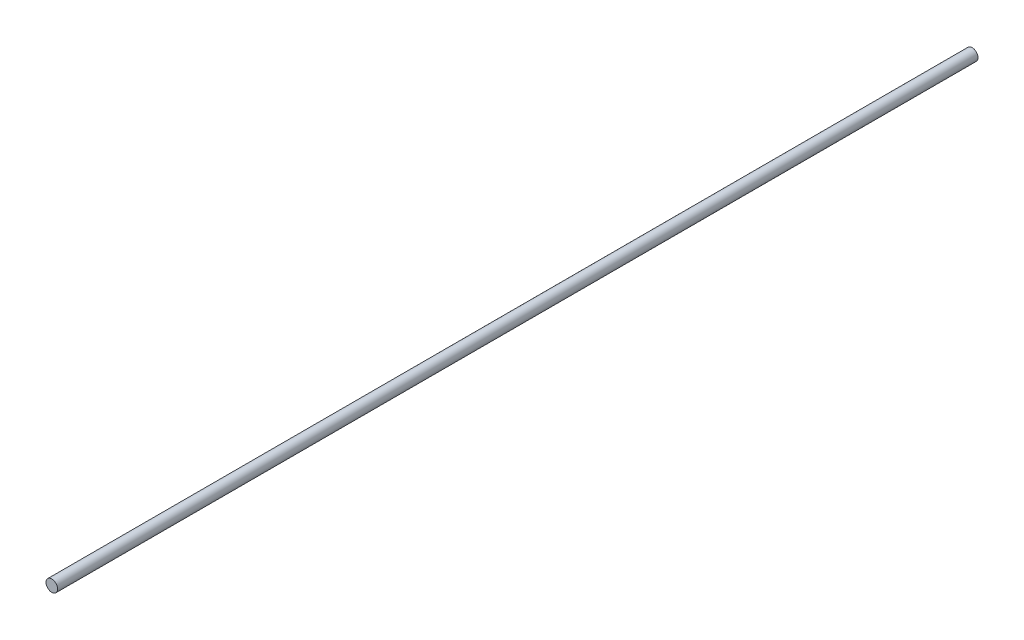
ISO-10303-21;
HEADER;
FILE_DESCRIPTION(('STEP AP214'),'2;1');
FILE_NAME('part.step','',(''),(''),'','','');
FILE_SCHEMA(('AUTOMOTIVE_DESIGN { 1 0 10303 214 1 1 1 1 }'));
ENDSEC;
DATA;
#1=APPLICATION_CONTEXT('core data for automotive mechanical design processes');
#2=APPLICATION_PROTOCOL_DEFINITION('international standard','automotive_design',2000,#1);
#3=PRODUCT_CONTEXT('',#1,'mechanical');
#4=PRODUCT('Part','Part','',(#3));
#5=PRODUCT_RELATED_PRODUCT_CATEGORY('part','',(#4));
#6=PRODUCT_DEFINITION_FORMATION('','',#4);
#7=PRODUCT_DEFINITION_CONTEXT('part definition',#1,'design');
#8=PRODUCT_DEFINITION('design','',#6,#7);
#9=PRODUCT_DEFINITION_SHAPE('','',#8);
#10=(LENGTH_UNIT() NAMED_UNIT(*) SI_UNIT(.MILLI.,.METRE.));
#11=(NAMED_UNIT(*) PLANE_ANGLE_UNIT() SI_UNIT($,.RADIAN.));
#12=(NAMED_UNIT(*) SI_UNIT($,.STERADIAN.) SOLID_ANGLE_UNIT());
#13=UNCERTAINTY_MEASURE_WITH_UNIT(LENGTH_MEASURE(1.E-05),#10,'distance_accuracy_value','');
#14=(GEOMETRIC_REPRESENTATION_CONTEXT(3) GLOBAL_UNCERTAINTY_ASSIGNED_CONTEXT((#13)) GLOBAL_UNIT_ASSIGNED_CONTEXT((#10,
#11,#12)) REPRESENTATION_CONTEXT('',''));
#15=CARTESIAN_POINT('',(0.,0.,0.));
#16=DIRECTION('',(0.,0.,1.));
#17=DIRECTION('',(1.,0.,0.));
#18=AXIS2_PLACEMENT_3D('',#15,#16,#17);
#19=CARTESIAN_POINT('',(0.,0.,-4750.));
#20=DIRECTION('',(0.,0.,1.));
#21=DIRECTION('',(1.,0.,0.));
#22=AXIS2_PLACEMENT_3D('',#19,#20,#21);
#23=CYLINDRICAL_SURFACE('',#22,30.);
#24=CARTESIAN_POINT('',(0.,0.,-4750.));
#25=DIRECTION('',(0.,0.,1.));
#26=DIRECTION('',(1.,0.,0.));
#27=AXIS2_PLACEMENT_3D('',#24,#25,#26);
#28=CIRCLE('',#27,30.);
#29=CARTESIAN_POINT('',(30.,0.,-4750.));
#30=VERTEX_POINT('',#29);
#31=EDGE_CURVE('E10',#30,#30,#28,.T.);
#32=ORIENTED_EDGE('',*,*,#31,.T.);
#33=EDGE_LOOP('',(#32));
#34=FACE_BOUND('',#33,.T.);
#35=CARTESIAN_POINT('',(0.,0.,0.));
#36=DIRECTION('',(0.,0.,1.));
#37=DIRECTION('',(1.,0.,0.));
#38=AXIS2_PLACEMENT_3D('',#35,#36,#37);
#39=CIRCLE('',#38,30.);
#40=CARTESIAN_POINT('',(30.,0.,0.));
#41=VERTEX_POINT('',#40);
#42=EDGE_CURVE('E40',#41,#41,#39,.T.);
#43=ORIENTED_EDGE('',*,*,#42,.F.);
#44=EDGE_LOOP('',(#43));
#45=FACE_BOUND('',#44,.T.);
#46=ADVANCED_FACE('F37',(#34,#45),#23,.T.);
#47=CARTESIAN_POINT('',(0.,0.,-4750.));
#48=DIRECTION('',(0.,0.,1.));
#49=DIRECTION('',(1.,0.,0.));
#50=AXIS2_PLACEMENT_3D('',#47,#48,#49);
#51=PLANE('',#50);
#52=ORIENTED_EDGE('',*,*,#31,.F.);
#53=EDGE_LOOP('',(#52));
#54=FACE_BOUND('',#53,.T.);
#55=ADVANCED_FACE('F54',(#54),#51,.F.);
#56=CARTESIAN_POINT('',(0.,0.,0.));
#57=DIRECTION('',(0.,0.,1.));
#58=DIRECTION('',(1.,0.,0.));
#59=AXIS2_PLACEMENT_3D('',#56,#57,#58);
#60=PLANE('',#59);
#61=ORIENTED_EDGE('',*,*,#42,.T.);
#62=EDGE_LOOP('',(#61));
#63=FACE_BOUND('',#62,.T.);
#64=ADVANCED_FACE('F51',(#63),#60,.T.);
#65=CLOSED_SHELL('',(#46,#55,#64));
#66=MANIFOLD_SOLID_BREP('B2',#65);
#67=ADVANCED_BREP_SHAPE_REPRESENTATION('',(#18,#66),#14);
#68=SHAPE_DEFINITION_REPRESENTATION(#9,#67);
ENDSEC;
END-ISO-10303-21;
